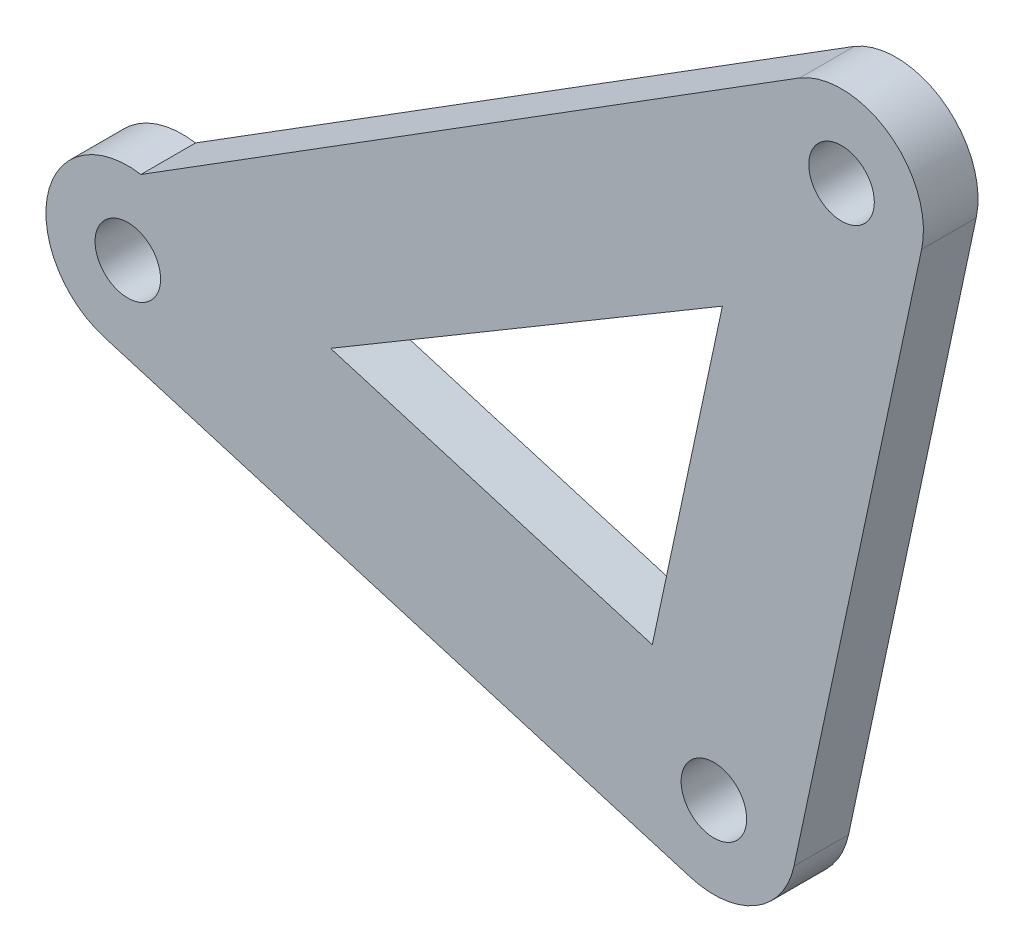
from build123d import *

# Parameters (mm, degrees)
BOSS_EXTRU_1_DEPTH           = 5
ENL_V_MAT_EXTRU_1_DEPTH      = 139.157198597
ENL_V_MAT_EXTRU_1_DEPTH_BACK = 139.157198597
ESQUISSE2_R                  = 3


with BuildPart() as part:
    # Esquisse1 → Boss.-Extru.1 (new body)
    with BuildSketch(Plane.XY):
        with BuildLine():
            Line((-56.665274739, -5.565824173), (-44.973787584, 49.200124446))
            ThreePointArc((-44.973787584, 49.200124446), (-47.933589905, 56.857750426), (-56.135496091, 57.216080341))
            Line((-56.135496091, 57.216080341), (-116.469329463, 19.389145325))
            ThreePointArc((-116.469329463, 19.389145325), (-124.980595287, 13.660058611), (-119.810809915, 4.797925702))
            Line((-119.810809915, 4.797925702), (-66.140962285, -11.187926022))
            ThreePointArc((-66.140962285, -11.187926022), (-60.173016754, -10.450131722), (-56.665274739, -5.565824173))
        make_face()
        Polygon((-63.221488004, 35.570325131), (-69.639764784, 5.505457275), (-99.102905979, 14.281211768), align=None, mode=Mode.SUBTRACT)
    extrude(amount=-BOSS_EXTRU_1_DEPTH)

    # Esquisse2 → Enl_v. mat.-Extru.1 (cut, two sides: drawn at the far end of the back side and taken through both)
    with BuildSketch(Plane.XY.offset(-ENL_V_MAT_EXTRU_1_DEPTH_BACK)):
        with Locations((-117.66984763, 11.985851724)):
            Circle(ESQUISSE2_R)
        with Locations((-64, -4)):
            Circle(ESQUISSE2_R)
        with Locations((-52.308512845, 50.765948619)):
            Circle(ESQUISSE2_R)
    extrude(amount=ENL_V_MAT_EXTRU_1_DEPTH + ENL_V_MAT_EXTRU_1_DEPTH_BACK, mode=Mode.SUBTRACT)


solid = part.part
